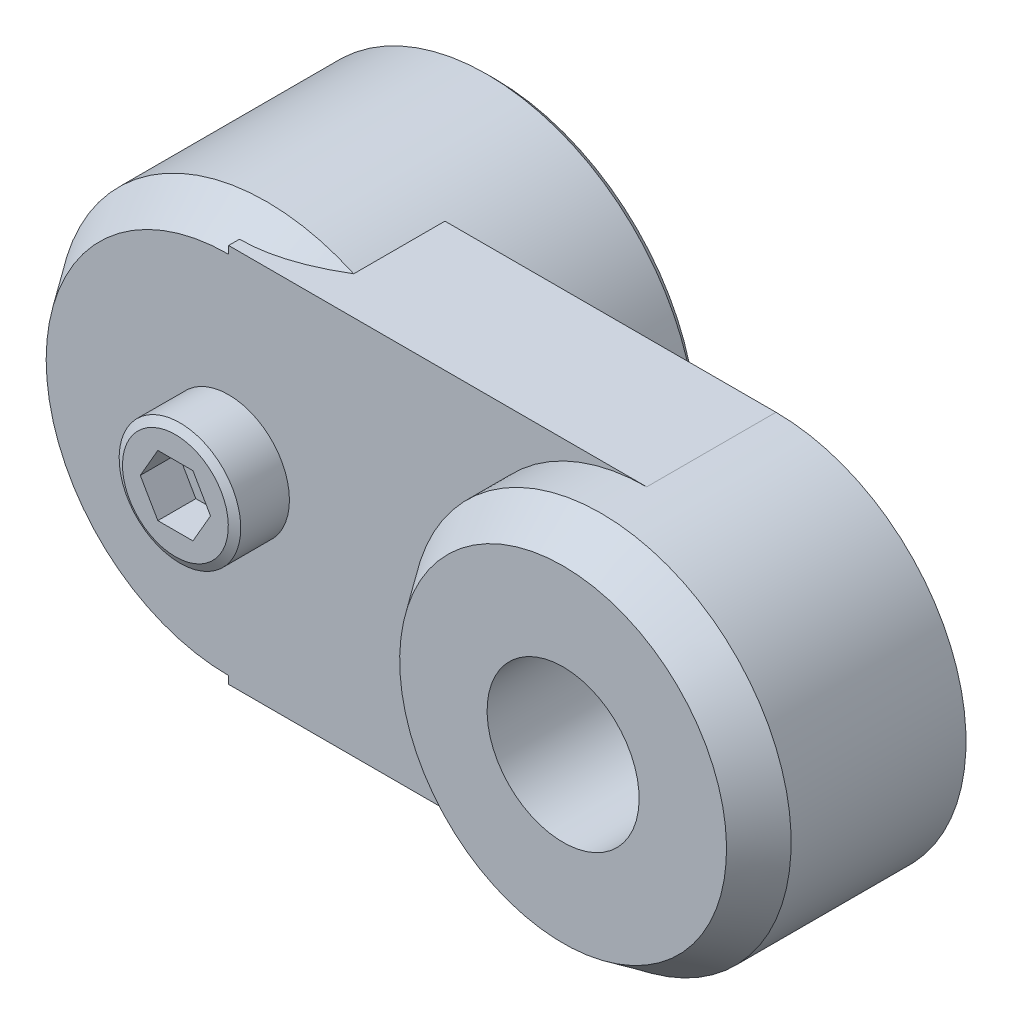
ISO-10303-21;
HEADER;
FILE_DESCRIPTION(('STEP AP214'),'2;1');
FILE_NAME('part.step','',(''),(''),'','','');
FILE_SCHEMA(('AUTOMOTIVE_DESIGN { 1 0 10303 214 1 1 1 1 }'));
ENDSEC;
DATA;
#1=APPLICATION_CONTEXT('core data for automotive mechanical design processes');
#2=APPLICATION_PROTOCOL_DEFINITION('international standard','automotive_design',2000,#1);
#3=PRODUCT_CONTEXT('',#1,'mechanical');
#4=PRODUCT('Part','Part','',(#3));
#5=PRODUCT_RELATED_PRODUCT_CATEGORY('part','',(#4));
#6=PRODUCT_DEFINITION_FORMATION('','',#4);
#7=PRODUCT_DEFINITION_CONTEXT('part definition',#1,'design');
#8=PRODUCT_DEFINITION('design','',#6,#7);
#9=PRODUCT_DEFINITION_SHAPE('','',#8);
#10=(LENGTH_UNIT() NAMED_UNIT(*) SI_UNIT(.MILLI.,.METRE.));
#11=(NAMED_UNIT(*) PLANE_ANGLE_UNIT() SI_UNIT($,.RADIAN.));
#12=(NAMED_UNIT(*) SI_UNIT($,.STERADIAN.) SOLID_ANGLE_UNIT());
#13=UNCERTAINTY_MEASURE_WITH_UNIT(LENGTH_MEASURE(1.E-05),#10,'distance_accuracy_value','');
#14=(GEOMETRIC_REPRESENTATION_CONTEXT(3) GLOBAL_UNCERTAINTY_ASSIGNED_CONTEXT((#13)) GLOBAL_UNIT_ASSIGNED_CONTEXT((#10,
#11,#12)) REPRESENTATION_CONTEXT('',''));
#15=CARTESIAN_POINT('',(0.,0.,0.));
#16=DIRECTION('',(0.,0.,1.));
#17=DIRECTION('',(1.,0.,0.));
#18=AXIS2_PLACEMENT_3D('',#15,#16,#17);
#19=CARTESIAN_POINT('',(0.,0.,35.));
#20=DIRECTION('',(0.,0.,1.));
#21=DIRECTION('',(0.,1.,0.));
#22=AXIS2_PLACEMENT_3D('',#19,#20,#21);
#23=PLANE('',#22);
#24=DIRECTION('',(-1.,0.,0.));
#25=VECTOR('',#24,1.);
#26=CARTESIAN_POINT('',(225.,-25.,35.));
#27=LINE('',#26,#25);
#28=CARTESIAN_POINT('',(55.,-25.,35.));
#29=VERTEX_POINT('',#28);
#30=CARTESIAN_POINT('',(0.,-25.,35.));
#31=VERTEX_POINT('',#30);
#32=EDGE_CURVE('E193',#29,#31,#27,.T.);
#33=ORIENTED_EDGE('',*,*,#32,.F.);
#34=CARTESIAN_POINT('',(55.,0.,35.));
#35=DIRECTION('',(0.,0.,1.));
#36=DIRECTION('',(0.,1.,0.));
#37=AXIS2_PLACEMENT_3D('',#34,#35,#36);
#38=CIRCLE('',#37,25.);
#39=CARTESIAN_POINT('',(55.,25.,35.));
#40=VERTEX_POINT('',#39);
#41=EDGE_CURVE('E173',#40,#29,#38,.T.);
#42=ORIENTED_EDGE('',*,*,#41,.F.);
#43=DIRECTION('',(-1.,0.,0.));
#44=VECTOR('',#43,1.);
#45=CARTESIAN_POINT('',(225.,25.,35.));
#46=LINE('',#45,#44);
#47=CARTESIAN_POINT('',(0.,25.,35.));
#48=VERTEX_POINT('',#47);
#49=EDGE_CURVE('E195',#40,#48,#46,.T.);
#50=ORIENTED_EDGE('',*,*,#49,.T.);
#51=DIRECTION('',(0.,1.,0.));
#52=VECTOR('',#51,1.);
#53=CARTESIAN_POINT('',(0.,-25.,35.));
#54=LINE('',#53,#52);
#55=CARTESIAN_POINT('',(0.,23.9989623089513,35.));
#56=VERTEX_POINT('',#55);
#57=EDGE_CURVE('E185',#56,#48,#54,.T.);
#58=ORIENTED_EDGE('',*,*,#57,.F.);
#59=CARTESIAN_POINT('',(0.,0.,35.));
#60=DIRECTION('',(0.,0.,1.));
#61=DIRECTION('',(0.,1.,0.));
#62=AXIS2_PLACEMENT_3D('',#59,#60,#61);
#63=CIRCLE('',#62,23.9989623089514);
#64=CARTESIAN_POINT('',(0.,-23.9989623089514,35.));
#65=VERTEX_POINT('',#64);
#66=EDGE_CURVE('E204',#56,#65,#63,.T.);
#67=ORIENTED_EDGE('',*,*,#66,.T.);
#68=EDGE_CURVE('E186',#31,#65,#54,.T.);
#69=ORIENTED_EDGE('',*,*,#68,.F.);
#70=EDGE_LOOP('',(#33,#42,#50,#58,#67,#69));
#71=FACE_BOUND('',#70,.T.);
#72=CARTESIAN_POINT('',(0.,0.,35.));
#73=DIRECTION('',(0.,0.,1.));
#74=DIRECTION('',(0.,1.,0.));
#75=AXIS2_PLACEMENT_3D('',#72,#73,#74);
#76=CIRCLE('',#75,8.);
#77=CARTESIAN_POINT('',(0.,8.,35.));
#78=VERTEX_POINT('',#77);
#79=EDGE_CURVE('E164',#78,#78,#76,.T.);
#80=ORIENTED_EDGE('',*,*,#79,.F.);
#81=EDGE_LOOP('',(#80));
#82=FACE_BOUND('',#81,.T.);
#83=ADVANCED_FACE('F14',(#71,#82),#23,.T.);
#84=CARTESIAN_POINT('',(225.,-25.,18.));
#85=DIRECTION('',(0.,0.,1.));
#86=DIRECTION('',(0.,1.,0.));
#87=AXIS2_PLACEMENT_3D('',#84,#85,#86);
#88=PLANE('',#87);
#89=CARTESIAN_POINT('',(55.,0.,18.));
#90=DIRECTION('',(0.,0.,1.));
#91=DIRECTION('',(0.,1.,0.));
#92=AXIS2_PLACEMENT_3D('',#89,#90,#91);
#93=CIRCLE('',#92,10.);
#94=CARTESIAN_POINT('',(55.,10.,18.));
#95=VERTEX_POINT('',#94);
#96=EDGE_CURVE('E170',#95,#95,#93,.T.);
#97=ORIENTED_EDGE('',*,*,#96,.T.);
#98=EDGE_LOOP('',(#97));
#99=FACE_BOUND('',#98,.T.);
#100=CARTESIAN_POINT('',(55.,0.,18.));
#101=DIRECTION('',(0.,0.,1.));
#102=DIRECTION('',(0.,1.,0.));
#103=AXIS2_PLACEMENT_3D('',#100,#101,#102);
#104=CIRCLE('',#103,25.);
#105=CARTESIAN_POINT('',(55.,-25.,18.));
#106=VERTEX_POINT('',#105);
#107=CARTESIAN_POINT('',(55.,25.,18.));
#108=VERTEX_POINT('',#107);
#109=EDGE_CURVE('E180',#106,#108,#104,.T.);
#110=ORIENTED_EDGE('',*,*,#109,.F.);
#111=DIRECTION('',(-1.,0.,0.));
#112=VECTOR('',#111,1.);
#113=CARTESIAN_POINT('',(225.,-25.,18.));
#114=LINE('',#113,#112);
#115=CARTESIAN_POINT('',(11.4564392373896,-25.,18.));
#116=VERTEX_POINT('',#115);
#117=EDGE_CURVE('E191',#106,#116,#114,.T.);
#118=ORIENTED_EDGE('',*,*,#117,.T.);
#119=CARTESIAN_POINT('',(0.,0.,18.));
#120=DIRECTION('',(0.,0.,1.));
#121=DIRECTION('',(0.,1.,0.));
#122=AXIS2_PLACEMENT_3D('',#119,#120,#121);
#123=CIRCLE('',#122,27.5);
#124=CARTESIAN_POINT('',(11.4564392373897,25.,18.));
#125=VERTEX_POINT('',#124);
#126=EDGE_CURVE('E242',#116,#125,#123,.T.);
#127=ORIENTED_EDGE('',*,*,#126,.T.);
#128=DIRECTION('',(-1.,0.,0.));
#129=VECTOR('',#128,1.);
#130=CARTESIAN_POINT('',(225.,25.,18.));
#131=LINE('',#130,#129);
#132=EDGE_CURVE('E197',#108,#125,#131,.T.);
#133=ORIENTED_EDGE('',*,*,#132,.F.);
#134=EDGE_LOOP('',(#110,#118,#127,#133));
#135=FACE_BOUND('',#134,.T.);
#136=ADVANCED_FACE('F249',(#99,#135),#88,.F.);
#137=CARTESIAN_POINT('',(225.,25.,18.));
#138=DIRECTION('',(0.,-1.,0.));
#139=DIRECTION('',(0.,0.,1.));
#140=AXIS2_PLACEMENT_3D('',#137,#138,#139);
#141=PLANE('',#140);
#142=DIRECTION('',(0.,0.,1.));
#143=VECTOR('',#142,1.);
#144=CARTESIAN_POINT('',(55.,25.,-190.));
#145=LINE('',#144,#143);
#146=EDGE_CURVE('E177',#108,#40,#145,.T.);
#147=ORIENTED_EDGE('',*,*,#146,.F.);
#148=ORIENTED_EDGE('',*,*,#132,.T.);
#149=DIRECTION('',(0.,0.,-1.));
#150=VECTOR('',#149,1.);
#151=CARTESIAN_POINT('',(11.4564392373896,25.,35.));
#152=LINE('',#151,#150);
#153=CARTESIAN_POINT('',(11.4564392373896,25.,30.));
#154=VERTEX_POINT('',#153);
#155=EDGE_CURVE('E202',#125,#154,#152,.F.);
#156=ORIENTED_EDGE('',*,*,#155,.T.);
#157=CARTESIAN_POINT('',(23.5156337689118,25.,20.2574791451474));
#158=CARTESIAN_POINT('',(23.2610089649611,25.,20.5066251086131));
#159=CARTESIAN_POINT('',(23.0053157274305,25.,20.7546780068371));
#160=CARTESIAN_POINT('',(22.4916376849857,25.,21.2484095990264));
#161=CARTESIAN_POINT('',(22.2336528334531,25.,21.494088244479));
#162=CARTESIAN_POINT('',(21.4559147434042,25.,22.22738778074));
#163=CARTESIAN_POINT('',(20.9325052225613,25.,22.7111474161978));
#164=CARTESIAN_POINT('',(19.8703592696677,25.,23.6702717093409));
#165=CARTESIAN_POINT('',(19.3315334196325,25.,24.1455375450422));
#166=CARTESIAN_POINT('',(18.2410725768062,25.,25.0810986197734));
#167=CARTESIAN_POINT('',(17.6894385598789,25.,25.5413949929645));
#168=CARTESIAN_POINT('',(16.536069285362,25.,26.4724714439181));
#169=CARTESIAN_POINT('',(15.9333741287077,25.,26.9420679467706));
#170=CARTESIAN_POINT('',(14.7087965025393,25.,27.855905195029));
#171=CARTESIAN_POINT('',(14.0869108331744,25.,28.3001416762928));
#172=CARTESIAN_POINT('',(12.8233471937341,25.,29.1553203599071));
#173=CARTESIAN_POINT('',(12.1817372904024,25.,29.5663624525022));
#174=CARTESIAN_POINT('',(10.8745497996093,25.,30.3480942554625));
#175=CARTESIAN_POINT('',(10.2089835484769,25.,30.7188027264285));
#176=CARTESIAN_POINT('',(8.87691400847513,25.,31.3964503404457));
#177=CARTESIAN_POINT('',(8.21136361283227,25.,31.7052465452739));
#178=CARTESIAN_POINT('',(6.85530500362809,25.,32.2639642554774));
#179=CARTESIAN_POINT('',(6.16479209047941,25.,32.5138746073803));
#180=CARTESIAN_POINT('',(5.12030630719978,25.,32.8323618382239));
#181=CARTESIAN_POINT('',(4.77458189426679,25.,32.9283607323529));
#182=CARTESIAN_POINT('',(4.07850406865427,25.,33.101676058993));
#183=CARTESIAN_POINT('',(3.72815154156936,25.,33.178996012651));
#184=CARTESIAN_POINT('',(3.02379681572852,25.,33.3136098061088));
#185=CARTESIAN_POINT('',(2.66979659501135,25.,33.3709139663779));
#186=CARTESIAN_POINT('',(1.95902577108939,25.,33.464483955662));
#187=CARTESIAN_POINT('',(1.60225535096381,25.,33.5007511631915));
#188=CARTESIAN_POINT('',(0.940908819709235,25.,33.5477212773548));
#189=CARTESIAN_POINT('',(0.636544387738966,25.,33.5614464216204));
#190=CARTESIAN_POINT('',(0.0274690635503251,25.,33.5729969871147));
#191=CARTESIAN_POINT('',(-0.277241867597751,25.,33.5708203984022));
#192=CARTESIAN_POINT('',(-0.886299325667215,25.,33.5505875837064));
#193=CARTESIAN_POINT('',(-1.19064556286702,25.,33.5325226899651));
#194=CARTESIAN_POINT('',(-1.7979599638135,25.,33.480772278));
#195=CARTESIAN_POINT('',(-2.10092830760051,25.,33.4470888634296));
#196=CARTESIAN_POINT('',(-2.71519481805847,25.,33.3631579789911));
#197=CARTESIAN_POINT('',(-3.02642028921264,25.,33.3123797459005));
#198=CARTESIAN_POINT('',(-3.64596973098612,25.,33.1953433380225));
#199=CARTESIAN_POINT('',(-3.95429339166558,25.,33.1290835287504));
#200=CARTESIAN_POINT('',(-4.56711836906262,25.,32.9820375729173));
#201=CARTESIAN_POINT('',(-4.87162314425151,25.,32.9012657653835));
#202=CARTESIAN_POINT('',(-5.47661118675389,25.,32.7261638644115));
#203=CARTESIAN_POINT('',(-5.77709569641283,25.,32.6318380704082));
#204=CARTESIAN_POINT('',(-6.07541297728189,25.,32.5312150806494));
#205=B_SPLINE_CURVE_WITH_KNOTS('',3,(#157,#158,#159,#160,#161,#162,#163,#164,#165,#166,#167,
#168,#169,#170,#171,#172,#173,#174,#175,#176,#177,#178,#179,#180,#181,#182,#183,#184,#185,#186,
#187,#188,#189,#190,#191,#192,#193,#194,#195,#196,#197,#198,#199,#200,#201,#202,#203,#204),
.UNSPECIFIED.,.F.,.F.,(4,2,2,2,2,2,2,2,2,2,2,2,2,2,2,2,2,2,2,2,2,2,2,4),(0.,1.06871624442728,
2.13745427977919,4.27546508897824,6.43067282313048,8.58571688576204,10.8773030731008,
13.1692734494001,15.4540676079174,17.7377944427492,19.9367026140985,22.1360269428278,
23.2120150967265,24.2878002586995,25.3630299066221,26.4381890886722,27.3518103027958,
28.2655469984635,29.1797824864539,30.0938948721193,31.0395053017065,31.9852156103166,
32.9299965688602,33.8744784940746),.UNSPECIFIED.);
#206=CARTESIAN_POINT('',(0.,25.,33.5703700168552));
#207=VERTEX_POINT('',#206);
#208=EDGE_CURVE('E213',#207,#154,#205,.F.);
#209=ORIENTED_EDGE('',*,*,#208,.F.);
#210=DIRECTION('',(0.,0.,1.));
#211=VECTOR('',#210,1.);
#212=CARTESIAN_POINT('',(0.,25.,18.));
#213=LINE('',#212,#211);
#214=EDGE_CURVE('E182',#207,#48,#213,.T.);
#215=ORIENTED_EDGE('',*,*,#214,.T.);
#216=ORIENTED_EDGE('',*,*,#49,.F.);
#217=EDGE_LOOP('',(#147,#148,#156,#209,#215,#216));
#218=FACE_BOUND('',#217,.T.);
#219=ADVANCED_FACE('F224',(#218),#141,.F.);
#220=CARTESIAN_POINT('',(225.,-25.,18.));
#221=DIRECTION('',(0.,-1.,0.));
#222=DIRECTION('',(0.,0.,1.));
#223=AXIS2_PLACEMENT_3D('',#220,#221,#222);
#224=PLANE('',#223);
#225=ORIENTED_EDGE('',*,*,#117,.F.);
#226=DIRECTION('',(0.,0.,1.));
#227=VECTOR('',#226,1.);
#228=CARTESIAN_POINT('',(55.,-25.,-190.));
#229=LINE('',#228,#227);
#230=EDGE_CURVE('E37',#106,#29,#229,.T.);
#231=ORIENTED_EDGE('',*,*,#230,.T.);
#232=ORIENTED_EDGE('',*,*,#32,.T.);
#233=DIRECTION('',(0.,0.,1.));
#234=VECTOR('',#233,1.);
#235=CARTESIAN_POINT('',(0.,-25.,18.));
#236=LINE('',#235,#234);
#237=CARTESIAN_POINT('',(0.,-25.,33.5703700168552));
#238=VERTEX_POINT('',#237);
#239=EDGE_CURVE('E188',#238,#31,#236,.T.);
#240=ORIENTED_EDGE('',*,*,#239,.F.);
#241=CARTESIAN_POINT('',(23.5156337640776,-25.,20.2574791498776));
#242=CARTESIAN_POINT('',(23.261008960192,-25.,20.5066251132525));
#243=CARTESIAN_POINT('',(23.0053157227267,-25.,20.7546780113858));
#244=CARTESIAN_POINT('',(22.4916376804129,-25.,21.2484096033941));
#245=CARTESIAN_POINT('',(22.2336528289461,-25.,21.4940882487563));
#246=CARTESIAN_POINT('',(21.4559147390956,-25.,22.2273877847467));
#247=CARTESIAN_POINT('',(20.9325052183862,-25.,22.7111474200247));
#248=CARTESIAN_POINT('',(19.8703592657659,-25.,23.6702717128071));
#249=CARTESIAN_POINT('',(19.3315334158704,-25.,24.1455375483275));
#250=CARTESIAN_POINT('',(18.2410725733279,-25.,25.0810986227));
#251=CARTESIAN_POINT('',(17.6894385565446,-25.,25.5413949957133));
#252=CARTESIAN_POINT('',(16.5360692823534,-25.,26.4724714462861));
#253=CARTESIAN_POINT('',(15.9333741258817,-25.,26.9420679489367));
#254=CARTESIAN_POINT('',(14.7087965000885,-25.,27.8559051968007));
#255=CARTESIAN_POINT('',(14.086910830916,-25.,28.3001416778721));
#256=CARTESIAN_POINT('',(12.8233471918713,-25.,29.1553203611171));
#257=CARTESIAN_POINT('',(12.1817372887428,-25.,29.5663624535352));
#258=CARTESIAN_POINT('',(10.8745497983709,-25.,30.3480942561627));
#259=CARTESIAN_POINT('',(10.2089835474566,-25.,30.7188027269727));
#260=CARTESIAN_POINT('',(8.8769140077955,-25.,31.3964503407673));
#261=CARTESIAN_POINT('',(8.21136361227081,-25.,31.7052465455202));
#262=CARTESIAN_POINT('',(6.85530500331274,-25.,32.2639642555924));
#263=CARTESIAN_POINT('',(6.16479209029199,-25.,32.5138746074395));
#264=CARTESIAN_POINT('',(5.12030630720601,-25.,32.832361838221));
#265=CARTESIAN_POINT('',(4.77458189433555,-25.,32.9283607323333));
#266=CARTESIAN_POINT('',(4.07850406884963,-25.,33.1016760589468));
#267=CARTESIAN_POINT('',(3.72815154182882,-25.,33.1789960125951));
#268=CARTESIAN_POINT('',(3.02379681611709,-25.,33.3136098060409));
#269=CARTESIAN_POINT('',(2.66979659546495,-25.,33.3709139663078));
#270=CARTESIAN_POINT('',(1.95902577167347,-25.,33.4644839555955));
#271=CARTESIAN_POINT('',(1.60225535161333,-25.,33.5007511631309));
#272=CARTESIAN_POINT('',(0.940908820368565,-25.,33.5477212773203));
#273=CARTESIAN_POINT('',(0.636544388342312,-25.,33.5614464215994));
#274=CARTESIAN_POINT('',(0.0274690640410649,-25.,33.5729969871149));
#275=CARTESIAN_POINT('',(-0.277241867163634,-25.,33.5708203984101));
#276=CARTESIAN_POINT('',(-0.886299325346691,-25.,33.5505875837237));
#277=CARTESIAN_POINT('',(-1.19064556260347,-25.,33.532522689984));
#278=CARTESIAN_POINT('',(-1.79795996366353,-25.,33.4807722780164));
#279=CARTESIAN_POINT('',(-2.10092830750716,-25.,33.4470888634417));
#280=CARTESIAN_POINT('',(-2.71519481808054,-25.,33.3631579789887));
#281=CARTESIAN_POINT('',(-3.02642028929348,-25.,33.3123797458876));
#282=CARTESIAN_POINT('',(-3.6459697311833,-25.,33.1953433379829));
#283=CARTESIAN_POINT('',(-3.95429339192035,-25.,33.1290835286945));
#284=CARTESIAN_POINT('',(-4.56711836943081,-25.,32.9820375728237));
#285=CARTESIAN_POINT('',(-4.87162314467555,-25.,32.9012657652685));
#286=CARTESIAN_POINT('',(-5.47661118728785,-25.,32.7261638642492));
#287=CARTESIAN_POINT('',(-5.77709569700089,-25.,32.63183807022));
#288=CARTESIAN_POINT('',(-6.07541297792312,-25.,32.5312150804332));
#289=B_SPLINE_CURVE_WITH_KNOTS('',3,(#241,#242,#243,#244,#245,#246,#247,#248,#249,#250,#251,
#252,#253,#254,#255,#256,#257,#258,#259,#260,#261,#262,#263,#264,#265,#266,#267,#268,#269,#270,
#271,#272,#273,#274,#275,#276,#277,#278,#279,#280,#281,#282,#283,#284,#285,#286,#287,#288),
.UNSPECIFIED.,.F.,.F.,(4,2,2,2,2,2,2,2,2,2,2,2,2,2,2,2,2,2,2,2,2,2,2,4),(0.,1.06871624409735,
2.13745427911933,4.27546508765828,6.43067282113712,8.58571688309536,10.8773030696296,
13.1692734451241,15.4540676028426,17.7377944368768,19.9367026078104,22.1360269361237,
23.2120150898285,24.2878002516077,25.3630298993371,26.438189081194,27.351810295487,
28.2655469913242,29.1797824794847,30.09389486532,31.0395052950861,31.9852156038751,
32.9299965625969,33.8744784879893),.UNSPECIFIED.);
#290=CARTESIAN_POINT('',(11.4564392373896,-25.,30.));
#291=VERTEX_POINT('',#290);
#292=EDGE_CURVE('E236',#238,#291,#289,.F.);
#293=ORIENTED_EDGE('',*,*,#292,.T.);
#294=DIRECTION('',(0.,0.,-1.));
#295=VECTOR('',#294,1.);
#296=CARTESIAN_POINT('',(11.4564392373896,-25.,35.));
#297=LINE('',#296,#295);
#298=EDGE_CURVE('E199',#116,#291,#297,.F.);
#299=ORIENTED_EDGE('',*,*,#298,.F.);
#300=EDGE_LOOP('',(#225,#231,#232,#240,#293,#299));
#301=FACE_BOUND('',#300,.T.);
#302=ADVANCED_FACE('F244',(#301),#224,.T.);
#303=CARTESIAN_POINT('',(0.,0.,35.));
#304=DIRECTION('',(0.,0.,-1.));
#305=DIRECTION('',(0.,-1.,0.));
#306=AXIS2_PLACEMENT_3D('',#303,#304,#305);
#307=CYLINDRICAL_SURFACE('',#306,27.5);
#308=CARTESIAN_POINT('',(0.,0.,1.00000000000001));
#309=DIRECTION('',(0.,0.,1.));
#310=DIRECTION('',(0.,1.,0.));
#311=AXIS2_PLACEMENT_3D('',#308,#309,#310);
#312=CIRCLE('',#311,27.5);
#313=CARTESIAN_POINT('',(0.,27.5,1.00000000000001));
#314=VERTEX_POINT('',#313);
#315=EDGE_CURVE('E330',#314,#314,#312,.T.);
#316=ORIENTED_EDGE('',*,*,#315,.T.);
#317=EDGE_LOOP('',(#316));
#318=FACE_BOUND('',#317,.T.);
#319=ORIENTED_EDGE('',*,*,#155,.F.);
#320=ORIENTED_EDGE('',*,*,#126,.F.);
#321=ORIENTED_EDGE('',*,*,#298,.T.);
#322=CARTESIAN_POINT('',(0.,0.,30.));
#323=DIRECTION('',(0.,0.,1.));
#324=DIRECTION('',(0.,1.,0.));
#325=AXIS2_PLACEMENT_3D('',#322,#323,#324);
#326=CIRCLE('',#325,27.5);
#327=EDGE_CURVE('E207',#291,#154,#326,.F.);
#328=ORIENTED_EDGE('',*,*,#327,.T.);
#329=EDGE_LOOP('',(#319,#320,#321,#328));
#330=FACE_BOUND('',#329,.T.);
#331=ADVANCED_FACE('F248',(#318,#330),#307,.T.);
#332=CARTESIAN_POINT('',(0.,0.,0.));
#333=DIRECTION('',(0.,0.,1.));
#334=DIRECTION('',(0.,1.,0.));
#335=AXIS2_PLACEMENT_3D('',#332,#333,#334);
#336=PLANE('',#335);
#337=CARTESIAN_POINT('',(0.,0.,0.));
#338=DIRECTION('',(0.,0.,1.));
#339=DIRECTION('',(0.,1.,0.));
#340=AXIS2_PLACEMENT_3D('',#337,#338,#339);
#341=CIRCLE('',#340,26.5);
#342=CARTESIAN_POINT('',(0.,26.5,0.));
#343=VERTEX_POINT('',#342);
#344=EDGE_CURVE('E505',#343,#343,#341,.F.);
#345=ORIENTED_EDGE('',*,*,#344,.T.);
#346=EDGE_LOOP('',(#345));
#347=FACE_BOUND('',#346,.T.);
#348=ADVANCED_FACE('F232',(#347),#336,.F.);
#349=CARTESIAN_POINT('',(0.,0.,35.));
#350=DIRECTION('',(0.,0.,-1.));
#351=DIRECTION('',(0.,-1.,0.));
#352=AXIS2_PLACEMENT_3D('',#349,#350,#351);
#353=CONICAL_SURFACE('',#352,23.9989623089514,0.610865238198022);
#354=ORIENTED_EDGE('',*,*,#292,.F.);
#355=DIRECTION('',(0.,-0.573576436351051,-0.819152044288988));
#356=VECTOR('',#355,1.);
#357=CARTESIAN_POINT('',(0.,0.,69.2740701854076));
#358=LINE('',#357,#356);
#359=EDGE_CURVE('E222',#238,#65,#358,.F.);
#360=ORIENTED_EDGE('',*,*,#359,.T.);
#361=ORIENTED_EDGE('',*,*,#66,.F.);
#362=DIRECTION('',(0.,-0.573576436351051,0.819152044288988));
#363=VECTOR('',#362,1.);
#364=CARTESIAN_POINT('',(0.,0.,69.2740701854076));
#365=LINE('',#364,#363);
#366=EDGE_CURVE('E210',#56,#207,#365,.F.);
#367=ORIENTED_EDGE('',*,*,#366,.T.);
#368=ORIENTED_EDGE('',*,*,#208,.T.);
#369=ORIENTED_EDGE('',*,*,#327,.F.);
#370=EDGE_LOOP('',(#354,#360,#361,#367,#368,#369));
#371=FACE_BOUND('',#370,.T.);
#372=ADVANCED_FACE('F227',(#371),#353,.T.);
#373=CARTESIAN_POINT('',(0.,25.,18.));
#374=DIRECTION('',(1.,0.,0.));
#375=DIRECTION('',(0.,0.,-1.));
#376=AXIS2_PLACEMENT_3D('',#373,#374,#375);
#377=PLANE('',#376);
#378=ORIENTED_EDGE('',*,*,#359,.F.);
#379=ORIENTED_EDGE('',*,*,#239,.T.);
#380=ORIENTED_EDGE('',*,*,#68,.T.);
#381=EDGE_LOOP('',(#378,#379,#380));
#382=FACE_BOUND('',#381,.T.);
#383=ADVANCED_FACE('F231',(#382),#377,.F.);
#384=ORIENTED_EDGE('',*,*,#366,.F.);
#385=ORIENTED_EDGE('',*,*,#57,.T.);
#386=ORIENTED_EDGE('',*,*,#214,.F.);
#387=EDGE_LOOP('',(#384,#385,#386));
#388=FACE_BOUND('',#387,.T.);
#389=ADVANCED_FACE('F253',(#388),#377,.F.);
#390=CARTESIAN_POINT('',(55.,0.,-190.));
#391=DIRECTION('',(0.,0.,1.));
#392=DIRECTION('',(0.,1.,0.));
#393=AXIS2_PLACEMENT_3D('',#390,#391,#392);
#394=CYLINDRICAL_SURFACE('',#393,25.);
#395=CARTESIAN_POINT('',(55.,0.,41.));
#396=DIRECTION('',(0.,0.,1.));
#397=DIRECTION('',(0.,1.,0.));
#398=AXIS2_PLACEMENT_3D('',#395,#396,#397);
#399=CIRCLE('',#398,25.);
#400=CARTESIAN_POINT('',(55.,25.,41.));
#401=VERTEX_POINT('',#400);
#402=EDGE_CURVE('E498',#401,#401,#399,.F.);
#403=ORIENTED_EDGE('',*,*,#402,.T.);
#404=EDGE_LOOP('',(#403));
#405=FACE_BOUND('',#404,.T.);
#406=ORIENTED_EDGE('',*,*,#109,.T.);
#407=ORIENTED_EDGE('',*,*,#146,.T.);
#408=ORIENTED_EDGE('',*,*,#41,.T.);
#409=ORIENTED_EDGE('',*,*,#230,.F.);
#410=EDGE_LOOP('',(#406,#407,#408,#409));
#411=FACE_BOUND('',#410,.T.);
#412=ADVANCED_FACE('F256',(#405,#411),#394,.T.);
#413=CARTESIAN_POINT('',(55.,0.,46.));
#414=DIRECTION('',(0.,0.,1.));
#415=DIRECTION('',(0.,1.,0.));
#416=AXIS2_PLACEMENT_3D('',#413,#414,#415);
#417=PLANE('',#416);
#418=CARTESIAN_POINT('',(55.,0.,46.));
#419=DIRECTION('',(0.,0.,1.));
#420=DIRECTION('',(0.,1.,0.));
#421=AXIS2_PLACEMENT_3D('',#418,#419,#420);
#422=CIRCLE('',#421,10.);
#423=CARTESIAN_POINT('',(55.,10.,46.));
#424=VERTEX_POINT('',#423);
#425=EDGE_CURVE('E167',#424,#424,#422,.T.);
#426=ORIENTED_EDGE('',*,*,#425,.F.);
#427=EDGE_LOOP('',(#426));
#428=FACE_BOUND('',#427,.T.);
#429=CARTESIAN_POINT('',(55.,0.,46.));
#430=DIRECTION('',(0.,0.,1.));
#431=DIRECTION('',(0.,1.,0.));
#432=AXIS2_PLACEMENT_3D('',#429,#430,#431);
#433=CIRCLE('',#432,21.4989623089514);
#434=CARTESIAN_POINT('',(55.,21.4989623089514,46.));
#435=VERTEX_POINT('',#434);
#436=EDGE_CURVE('E496',#435,#435,#433,.T.);
#437=ORIENTED_EDGE('',*,*,#436,.T.);
#438=EDGE_LOOP('',(#437));
#439=FACE_BOUND('',#438,.T.);
#440=ADVANCED_FACE('F260',(#428,#439),#417,.T.);
#441=CARTESIAN_POINT('',(55.,0.,46.));
#442=DIRECTION('',(0.,0.,-1.));
#443=DIRECTION('',(0.,-1.,0.));
#444=AXIS2_PLACEMENT_3D('',#441,#442,#443);
#445=CONICAL_SURFACE('',#444,21.4989623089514,0.610865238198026);
#446=ORIENTED_EDGE('',*,*,#402,.F.);
#447=EDGE_LOOP('',(#446));
#448=FACE_BOUND('',#447,.T.);
#449=ORIENTED_EDGE('',*,*,#436,.F.);
#450=EDGE_LOOP('',(#449));
#451=FACE_BOUND('',#450,.T.);
#452=ADVANCED_FACE('F264',(#448,#451),#445,.T.);
#453=CARTESIAN_POINT('',(55.,0.,0.));
#454=DIRECTION('',(0.,0.,1.));
#455=DIRECTION('',(0.,1.,0.));
#456=AXIS2_PLACEMENT_3D('',#453,#454,#455);
#457=CYLINDRICAL_SURFACE('',#456,10.);
#458=ORIENTED_EDGE('',*,*,#425,.T.);
#459=EDGE_LOOP('',(#458));
#460=FACE_BOUND('',#459,.T.);
#461=ORIENTED_EDGE('',*,*,#96,.F.);
#462=EDGE_LOOP('',(#461));
#463=FACE_BOUND('',#462,.T.);
#464=ADVANCED_FACE('F268',(#460,#463),#457,.F.);
#465=CARTESIAN_POINT('',(0.,0.,42.));
#466=DIRECTION('',(0.,0.,-1.));
#467=DIRECTION('',(0.,-1.,0.));
#468=AXIS2_PLACEMENT_3D('',#465,#466,#467);
#469=CYLINDRICAL_SURFACE('',#468,8.);
#470=CARTESIAN_POINT('',(0.,0.,41.4));
#471=DIRECTION('',(0.,0.,1.));
#472=DIRECTION('',(0.,-1.,0.));
#473=AXIS2_PLACEMENT_3D('',#470,#471,#472);
#474=CIRCLE('',#473,8.);
#475=CARTESIAN_POINT('',(0.,-8.,41.4));
#476=VERTEX_POINT('',#475);
#477=EDGE_CURVE('E9',#476,#476,#474,.F.);
#478=ORIENTED_EDGE('',*,*,#477,.T.);
#479=EDGE_LOOP('',(#478));
#480=FACE_BOUND('',#479,.T.);
#481=ORIENTED_EDGE('',*,*,#79,.T.);
#482=EDGE_LOOP('',(#481));
#483=FACE_BOUND('',#482,.T.);
#484=ADVANCED_FACE('F272',(#480,#483),#469,.T.);
#485=CARTESIAN_POINT('',(0.,0.,42.));
#486=DIRECTION('',(0.,0.,1.));
#487=DIRECTION('',(0.,1.,0.));
#488=AXIS2_PLACEMENT_3D('',#485,#486,#487);
#489=PLANE('',#488);
#490=CARTESIAN_POINT('',(0.,0.,42.));
#491=DIRECTION('',(0.,0.,1.));
#492=DIRECTION('',(0.,-1.,0.));
#493=AXIS2_PLACEMENT_3D('',#490,#491,#492);
#494=CIRCLE('',#493,6.96076951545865);
#495=CARTESIAN_POINT('',(0.,-6.96076951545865,42.));
#496=VERTEX_POINT('',#495);
#497=EDGE_CURVE('E22',#496,#496,#494,.T.);
#498=ORIENTED_EDGE('',*,*,#497,.T.);
#499=EDGE_LOOP('',(#498));
#500=FACE_BOUND('',#499,.T.);
#501=DIRECTION('',(-0.5,-0.866025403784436,0.));
#502=VECTOR('',#501,1.);
#503=CARTESIAN_POINT('',(-2.30940107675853,4.,42.));
#504=LINE('',#503,#502);
#505=CARTESIAN_POINT('',(-2.30940107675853,4.,42.));
#506=VERTEX_POINT('',#505);
#507=CARTESIAN_POINT('',(-4.61880215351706,0.,42.));
#508=VERTEX_POINT('',#507);
#509=EDGE_CURVE('E29',#506,#508,#504,.T.);
#510=ORIENTED_EDGE('',*,*,#509,.F.);
#511=DIRECTION('',(1.,0.,0.));
#512=VECTOR('',#511,1.);
#513=CARTESIAN_POINT('',(-2.30940107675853,4.,42.));
#514=LINE('',#513,#512);
#515=CARTESIAN_POINT('',(2.30940107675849,4.,42.));
#516=VERTEX_POINT('',#515);
#517=EDGE_CURVE('E138',#506,#516,#514,.T.);
#518=ORIENTED_EDGE('',*,*,#517,.T.);
#519=DIRECTION('',(0.5,-0.86602540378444,0.));
#520=VECTOR('',#519,1.);
#521=CARTESIAN_POINT('',(2.30940107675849,4.,42.));
#522=LINE('',#521,#520);
#523=CARTESIAN_POINT('',(4.61880215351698,0.,42.));
#524=VERTEX_POINT('',#523);
#525=EDGE_CURVE('E133',#516,#524,#522,.T.);
#526=ORIENTED_EDGE('',*,*,#525,.T.);
#527=DIRECTION('',(0.5,0.86602540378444,0.));
#528=VECTOR('',#527,1.);
#529=CARTESIAN_POINT('',(2.30940107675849,-4.,42.));
#530=LINE('',#529,#528);
#531=CARTESIAN_POINT('',(2.30940107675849,-4.,42.));
#532=VERTEX_POINT('',#531);
#533=EDGE_CURVE('E131',#532,#524,#530,.T.);
#534=ORIENTED_EDGE('',*,*,#533,.F.);
#535=DIRECTION('',(1.,0.,0.));
#536=VECTOR('',#535,1.);
#537=CARTESIAN_POINT('',(-2.30940107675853,-4.,42.));
#538=LINE('',#537,#536);
#539=CARTESIAN_POINT('',(-2.30940107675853,-4.,42.));
#540=VERTEX_POINT('',#539);
#541=EDGE_CURVE('E113',#540,#532,#538,.T.);
#542=ORIENTED_EDGE('',*,*,#541,.F.);
#543=DIRECTION('',(-0.5,0.866025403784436,0.));
#544=VECTOR('',#543,1.);
#545=CARTESIAN_POINT('',(-2.30940107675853,-4.,42.));
#546=LINE('',#545,#544);
#547=EDGE_CURVE('E124',#540,#508,#546,.T.);
#548=ORIENTED_EDGE('',*,*,#547,.T.);
#549=EDGE_LOOP('',(#510,#518,#526,#534,#542,#548));
#550=FACE_BOUND('',#549,.T.);
#551=ADVANCED_FACE('F128',(#500,#550),#489,.T.);
#552=CARTESIAN_POINT('',(-2.30940107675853,4.,37.));
#553=DIRECTION('',(-0.866025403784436,0.5,0.));
#554=DIRECTION('',(-0.5,-0.866025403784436,0.));
#555=AXIS2_PLACEMENT_3D('',#552,#553,#554);
#556=PLANE('',#555);
#557=DIRECTION('',(0.,0.,1.));
#558=VECTOR('',#557,1.);
#559=CARTESIAN_POINT('',(-2.30940107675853,4.,37.));
#560=LINE('',#559,#558);
#561=CARTESIAN_POINT('',(-2.30940107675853,4.,37.));
#562=VERTEX_POINT('',#561);
#563=EDGE_CURVE('E162',#562,#506,#560,.T.);
#564=ORIENTED_EDGE('',*,*,#563,.T.);
#565=ORIENTED_EDGE('',*,*,#509,.T.);
#566=DIRECTION('',(0.,0.,1.));
#567=VECTOR('',#566,1.);
#568=CARTESIAN_POINT('',(-4.61880215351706,0.,37.));
#569=LINE('',#568,#567);
#570=CARTESIAN_POINT('',(-4.61880215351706,0.,37.));
#571=VERTEX_POINT('',#570);
#572=EDGE_CURVE('E121',#571,#508,#569,.T.);
#573=ORIENTED_EDGE('',*,*,#572,.F.);
#574=DIRECTION('',(-0.5,-0.866025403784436,0.));
#575=VECTOR('',#574,1.);
#576=CARTESIAN_POINT('',(-2.30940107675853,4.,37.));
#577=LINE('',#576,#575);
#578=EDGE_CURVE('E141',#562,#571,#577,.T.);
#579=ORIENTED_EDGE('',*,*,#578,.F.);
#580=EDGE_LOOP('',(#564,#565,#573,#579));
#581=FACE_BOUND('',#580,.T.);
#582=ADVANCED_FACE('F277',(#581),#556,.F.);
#583=CARTESIAN_POINT('',(-2.30940107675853,4.,37.));
#584=DIRECTION('',(0.,-1.,0.));
#585=DIRECTION('',(1.,0.,0.));
#586=AXIS2_PLACEMENT_3D('',#583,#584,#585);
#587=PLANE('',#586);
#588=DIRECTION('',(0.,0.,1.));
#589=VECTOR('',#588,1.);
#590=CARTESIAN_POINT('',(2.30940107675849,4.,37.));
#591=LINE('',#590,#589);
#592=CARTESIAN_POINT('',(2.30940107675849,4.,37.));
#593=VERTEX_POINT('',#592);
#594=EDGE_CURVE('E160',#593,#516,#591,.T.);
#595=ORIENTED_EDGE('',*,*,#594,.T.);
#596=ORIENTED_EDGE('',*,*,#517,.F.);
#597=ORIENTED_EDGE('',*,*,#563,.F.);
#598=DIRECTION('',(1.,0.,0.));
#599=VECTOR('',#598,1.);
#600=CARTESIAN_POINT('',(-2.30940107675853,4.,37.));
#601=LINE('',#600,#599);
#602=EDGE_CURVE('E153',#562,#593,#601,.T.);
#603=ORIENTED_EDGE('',*,*,#602,.T.);
#604=EDGE_LOOP('',(#595,#596,#597,#603));
#605=FACE_BOUND('',#604,.T.);
#606=ADVANCED_FACE('F281',(#605),#587,.T.);
#607=CARTESIAN_POINT('',(2.30940107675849,4.,37.));
#608=DIRECTION('',(-0.86602540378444,-0.5,0.));
#609=DIRECTION('',(0.5,-0.86602540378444,0.));
#610=AXIS2_PLACEMENT_3D('',#607,#608,#609);
#611=PLANE('',#610);
#612=DIRECTION('',(0.,0.,1.));
#613=VECTOR('',#612,1.);
#614=CARTESIAN_POINT('',(4.61880215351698,0.,37.));
#615=LINE('',#614,#613);
#616=CARTESIAN_POINT('',(4.61880215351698,0.,37.));
#617=VERTEX_POINT('',#616);
#618=EDGE_CURVE('E158',#617,#524,#615,.T.);
#619=ORIENTED_EDGE('',*,*,#618,.T.);
#620=ORIENTED_EDGE('',*,*,#525,.F.);
#621=ORIENTED_EDGE('',*,*,#594,.F.);
#622=DIRECTION('',(0.5,-0.86602540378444,0.));
#623=VECTOR('',#622,1.);
#624=CARTESIAN_POINT('',(2.30940107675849,4.,37.));
#625=LINE('',#624,#623);
#626=EDGE_CURVE('E150',#593,#617,#625,.T.);
#627=ORIENTED_EDGE('',*,*,#626,.T.);
#628=EDGE_LOOP('',(#619,#620,#621,#627));
#629=FACE_BOUND('',#628,.T.);
#630=ADVANCED_FACE('F284',(#629),#611,.T.);
#631=CARTESIAN_POINT('',(2.30940107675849,-4.,37.));
#632=DIRECTION('',(0.86602540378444,-0.5,0.));
#633=DIRECTION('',(0.5,0.86602540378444,0.));
#634=AXIS2_PLACEMENT_3D('',#631,#632,#633);
#635=PLANE('',#634);
#636=DIRECTION('',(0.,0.,1.));
#637=VECTOR('',#636,1.);
#638=CARTESIAN_POINT('',(2.30940107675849,-4.,37.));
#639=LINE('',#638,#637);
#640=CARTESIAN_POINT('',(2.30940107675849,-4.,37.));
#641=VERTEX_POINT('',#640);
#642=EDGE_CURVE('E120',#641,#532,#639,.T.);
#643=ORIENTED_EDGE('',*,*,#642,.T.);
#644=ORIENTED_EDGE('',*,*,#533,.T.);
#645=ORIENTED_EDGE('',*,*,#618,.F.);
#646=DIRECTION('',(0.5,0.86602540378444,0.));
#647=VECTOR('',#646,1.);
#648=CARTESIAN_POINT('',(2.30940107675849,-4.,37.));
#649=LINE('',#648,#647);
#650=EDGE_CURVE('E147',#641,#617,#649,.T.);
#651=ORIENTED_EDGE('',*,*,#650,.F.);
#652=EDGE_LOOP('',(#643,#644,#645,#651));
#653=FACE_BOUND('',#652,.T.);
#654=ADVANCED_FACE('F288',(#653),#635,.F.);
#655=CARTESIAN_POINT('',(-2.30940107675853,-4.,37.));
#656=DIRECTION('',(0.,-1.,0.));
#657=DIRECTION('',(1.,0.,0.));
#658=AXIS2_PLACEMENT_3D('',#655,#656,#657);
#659=PLANE('',#658);
#660=DIRECTION('',(0.,0.,1.));
#661=VECTOR('',#660,1.);
#662=CARTESIAN_POINT('',(-2.30940107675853,-4.,37.));
#663=LINE('',#662,#661);
#664=CARTESIAN_POINT('',(-2.30940107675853,-4.,37.));
#665=VERTEX_POINT('',#664);
#666=EDGE_CURVE('E109',#665,#540,#663,.T.);
#667=ORIENTED_EDGE('',*,*,#666,.T.);
#668=ORIENTED_EDGE('',*,*,#541,.T.);
#669=ORIENTED_EDGE('',*,*,#642,.F.);
#670=DIRECTION('',(1.,0.,0.));
#671=VECTOR('',#670,1.);
#672=CARTESIAN_POINT('',(-2.30940107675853,-4.,37.));
#673=LINE('',#672,#671);
#674=EDGE_CURVE('E116',#665,#641,#673,.T.);
#675=ORIENTED_EDGE('',*,*,#674,.F.);
#676=EDGE_LOOP('',(#667,#668,#669,#675));
#677=FACE_BOUND('',#676,.T.);
#678=ADVANCED_FACE('F111',(#677),#659,.F.);
#679=CARTESIAN_POINT('',(-2.30940107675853,-4.,37.));
#680=DIRECTION('',(0.866025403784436,0.5,0.));
#681=DIRECTION('',(-0.5,0.866025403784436,0.));
#682=AXIS2_PLACEMENT_3D('',#679,#680,#681);
#683=PLANE('',#682);
#684=DIRECTION('',(-0.5,0.866025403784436,0.));
#685=VECTOR('',#684,1.);
#686=CARTESIAN_POINT('',(-2.30940107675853,-4.,37.));
#687=LINE('',#686,#685);
#688=EDGE_CURVE('E144',#665,#571,#687,.T.);
#689=ORIENTED_EDGE('',*,*,#688,.T.);
#690=ORIENTED_EDGE('',*,*,#572,.T.);
#691=ORIENTED_EDGE('',*,*,#547,.F.);
#692=ORIENTED_EDGE('',*,*,#666,.F.);
#693=EDGE_LOOP('',(#689,#690,#691,#692));
#694=FACE_BOUND('',#693,.T.);
#695=ADVANCED_FACE('F125',(#694),#683,.T.);
#696=CARTESIAN_POINT('',(-4.61880215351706,0.,37.));
#697=DIRECTION('',(0.,0.,-1.));
#698=DIRECTION('',(0.,-1.,0.));
#699=AXIS2_PLACEMENT_3D('',#696,#697,#698);
#700=PLANE('',#699);
#701=ORIENTED_EDGE('',*,*,#578,.T.);
#702=ORIENTED_EDGE('',*,*,#688,.F.);
#703=ORIENTED_EDGE('',*,*,#674,.T.);
#704=ORIENTED_EDGE('',*,*,#650,.T.);
#705=ORIENTED_EDGE('',*,*,#626,.F.);
#706=ORIENTED_EDGE('',*,*,#602,.F.);
#707=EDGE_LOOP('',(#701,#702,#703,#704,#705,#706));
#708=FACE_BOUND('',#707,.T.);
#709=ADVANCED_FACE('F295',(#708),#700,.F.);
#710=CARTESIAN_POINT('',(0.,0.,1.00000000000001));
#711=DIRECTION('',(0.,0.,1.));
#712=DIRECTION('',(0.,1.,0.));
#713=AXIS2_PLACEMENT_3D('',#710,#711,#712);
#714=CONICAL_SURFACE('',#713,27.5,0.785398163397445);
#715=ORIENTED_EDGE('',*,*,#344,.F.);
#716=EDGE_LOOP('',(#715));
#717=FACE_BOUND('',#716,.T.);
#718=ORIENTED_EDGE('',*,*,#315,.F.);
#719=EDGE_LOOP('',(#718));
#720=FACE_BOUND('',#719,.T.);
#721=ADVANCED_FACE('F298',(#717,#720),#714,.T.);
#722=CARTESIAN_POINT('',(0.,0.,42.));
#723=DIRECTION('',(0.,0.,-1.));
#724=DIRECTION('',(0.,1.,0.));
#725=AXIS2_PLACEMENT_3D('',#722,#723,#724);
#726=CONICAL_SURFACE('',#725,6.96076951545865,1.0471975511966);
#727=ORIENTED_EDGE('',*,*,#477,.F.);
#728=EDGE_LOOP('',(#727));
#729=FACE_BOUND('',#728,.T.);
#730=ORIENTED_EDGE('',*,*,#497,.F.);
#731=EDGE_LOOP('',(#730));
#732=FACE_BOUND('',#731,.T.);
#733=ADVANCED_FACE('F16',(#729,#732),#726,.T.);
#734=CLOSED_SHELL('',(#83,#136,#219,#302,#331,#348,#372,#383,#389,#412,#440,#452,#464,#484,#551,
#582,#606,#630,#654,#678,#695,#709,#721,#733));
#735=MANIFOLD_SOLID_BREP('B1',#734);
#736=ADVANCED_BREP_SHAPE_REPRESENTATION('',(#18,#735),#14);
#737=SHAPE_DEFINITION_REPRESENTATION(#9,#736);
ENDSEC;
END-ISO-10303-21;
